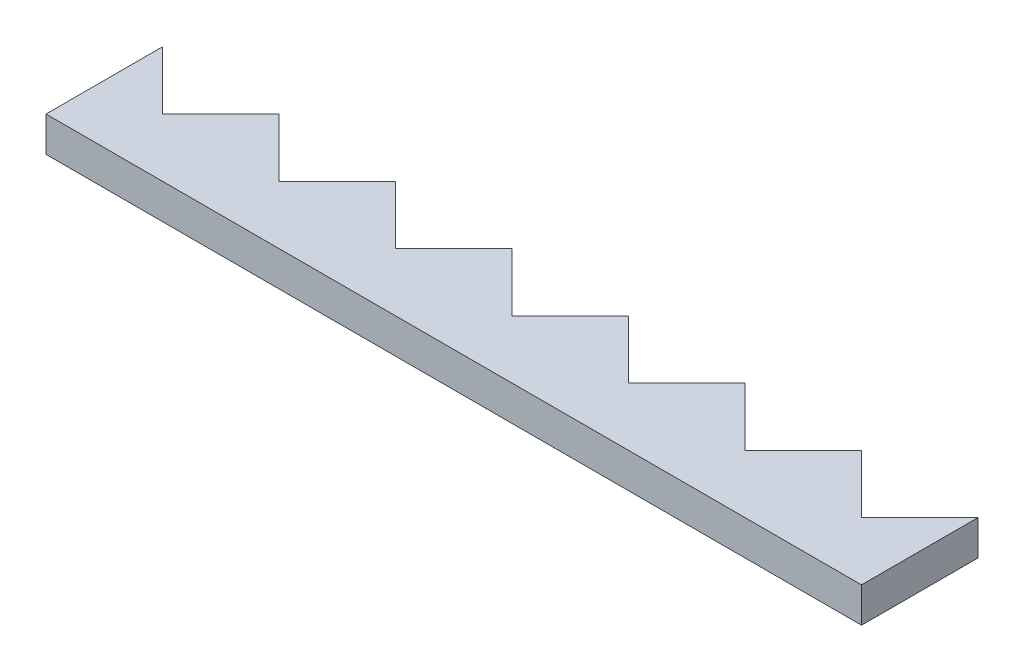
ISO-10303-21;
HEADER;
FILE_DESCRIPTION(('STEP AP214'),'2;1');
FILE_NAME('part.step','',(''),(''),'','','');
FILE_SCHEMA(('AUTOMOTIVE_DESIGN { 1 0 10303 214 1 1 1 1 }'));
ENDSEC;
DATA;
#1=APPLICATION_CONTEXT('core data for automotive mechanical design processes');
#2=APPLICATION_PROTOCOL_DEFINITION('international standard','automotive_design',2000,#1);
#3=PRODUCT_CONTEXT('',#1,'mechanical');
#4=PRODUCT('Part','Part','',(#3));
#5=PRODUCT_RELATED_PRODUCT_CATEGORY('part','',(#4));
#6=PRODUCT_DEFINITION_FORMATION('','',#4);
#7=PRODUCT_DEFINITION_CONTEXT('part definition',#1,'design');
#8=PRODUCT_DEFINITION('design','',#6,#7);
#9=PRODUCT_DEFINITION_SHAPE('','',#8);
#10=(LENGTH_UNIT() NAMED_UNIT(*) SI_UNIT(.MILLI.,.METRE.));
#11=(NAMED_UNIT(*) PLANE_ANGLE_UNIT() SI_UNIT($,.RADIAN.));
#12=(NAMED_UNIT(*) SI_UNIT($,.STERADIAN.) SOLID_ANGLE_UNIT());
#13=UNCERTAINTY_MEASURE_WITH_UNIT(LENGTH_MEASURE(1.E-05),#10,'distance_accuracy_value','');
#14=(GEOMETRIC_REPRESENTATION_CONTEXT(3) GLOBAL_UNCERTAINTY_ASSIGNED_CONTEXT((#13)) GLOBAL_UNIT_ASSIGNED_CONTEXT((#10,
#11,#12)) REPRESENTATION_CONTEXT('',''));
#15=CARTESIAN_POINT('',(0.,0.,0.));
#16=DIRECTION('',(0.,0.,1.));
#17=DIRECTION('',(1.,0.,0.));
#18=AXIS2_PLACEMENT_3D('',#15,#16,#17);
#19=CARTESIAN_POINT('',(0.,6.,0.));
#20=DIRECTION('',(0.,0.,-1.));
#21=DIRECTION('',(-1.,0.,0.));
#22=AXIS2_PLACEMENT_3D('',#19,#20,#21);
#23=PLANE('',#22);
#24=DIRECTION('',(1.,0.,0.));
#25=VECTOR('',#24,1.);
#26=CARTESIAN_POINT('',(0.,3.,0.));
#27=LINE('',#26,#25);
#28=CARTESIAN_POINT('',(0.,3.,0.));
#29=VERTEX_POINT('',#28);
#30=CARTESIAN_POINT('',(70.,3.,0.));
#31=VERTEX_POINT('',#30);
#32=EDGE_CURVE('E183',#29,#31,#27,.T.);
#33=ORIENTED_EDGE('',*,*,#32,.T.);
#34=DIRECTION('',(0.,-1.,0.));
#35=VECTOR('',#34,1.);
#36=CARTESIAN_POINT('',(70.,6.,0.));
#37=LINE('',#36,#35);
#38=CARTESIAN_POINT('',(70.,6.,0.));
#39=VERTEX_POINT('',#38);
#40=EDGE_CURVE('E11',#39,#31,#37,.T.);
#41=ORIENTED_EDGE('',*,*,#40,.F.);
#42=DIRECTION('',(1.,0.,0.));
#43=VECTOR('',#42,1.);
#44=CARTESIAN_POINT('',(0.,6.,0.));
#45=LINE('',#44,#43);
#46=CARTESIAN_POINT('',(0.,6.,0.));
#47=VERTEX_POINT('',#46);
#48=EDGE_CURVE('E215',#47,#39,#45,.T.);
#49=ORIENTED_EDGE('',*,*,#48,.F.);
#50=DIRECTION('',(0.,-1.,0.));
#51=VECTOR('',#50,1.);
#52=CARTESIAN_POINT('',(0.,6.,0.));
#53=LINE('',#52,#51);
#54=EDGE_CURVE('E179',#47,#29,#53,.T.);
#55=ORIENTED_EDGE('',*,*,#54,.T.);
#56=EDGE_LOOP('',(#33,#41,#49,#55));
#57=FACE_BOUND('',#56,.T.);
#58=ADVANCED_FACE('F33',(#57),#23,.F.);
#59=CARTESIAN_POINT('',(70.,6.,0.));
#60=DIRECTION('',(-1.,0.,0.));
#61=DIRECTION('',(0.,0.,1.));
#62=AXIS2_PLACEMENT_3D('',#59,#60,#61);
#63=PLANE('',#62);
#64=DIRECTION('',(0.,0.,-1.));
#65=VECTOR('',#64,1.);
#66=CARTESIAN_POINT('',(70.,3.,0.));
#67=LINE('',#66,#65);
#68=CARTESIAN_POINT('',(70.,3.,-10.));
#69=VERTEX_POINT('',#68);
#70=EDGE_CURVE('E186',#31,#69,#67,.T.);
#71=ORIENTED_EDGE('',*,*,#70,.T.);
#72=DIRECTION('',(0.,-1.,0.));
#73=VECTOR('',#72,1.);
#74=CARTESIAN_POINT('',(70.,6.,-10.));
#75=LINE('',#74,#73);
#76=CARTESIAN_POINT('',(70.,6.,-10.));
#77=VERTEX_POINT('',#76);
#78=EDGE_CURVE('E41',#77,#69,#75,.T.);
#79=ORIENTED_EDGE('',*,*,#78,.F.);
#80=DIRECTION('',(0.,0.,-1.));
#81=VECTOR('',#80,1.);
#82=CARTESIAN_POINT('',(70.,6.,0.));
#83=LINE('',#82,#81);
#84=EDGE_CURVE('E119',#39,#77,#83,.T.);
#85=ORIENTED_EDGE('',*,*,#84,.F.);
#86=ORIENTED_EDGE('',*,*,#40,.T.);
#87=EDGE_LOOP('',(#71,#79,#85,#86));
#88=FACE_BOUND('',#87,.T.);
#89=ADVANCED_FACE('F318',(#88),#63,.F.);
#90=CARTESIAN_POINT('',(65.,6.,-5.));
#91=DIRECTION('',(0.707106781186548,0.,0.707106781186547));
#92=DIRECTION('',(0.707106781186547,0.,-0.707106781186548));
#93=AXIS2_PLACEMENT_3D('',#90,#91,#92);
#94=PLANE('',#93);
#95=DIRECTION('',(-0.707106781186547,0.,0.707106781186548));
#96=VECTOR('',#95,1.);
#97=CARTESIAN_POINT('',(65.,3.,-5.));
#98=LINE('',#97,#96);
#99=CARTESIAN_POINT('',(65.,3.,-5.));
#100=VERTEX_POINT('',#99);
#101=EDGE_CURVE('E188',#69,#100,#98,.T.);
#102=ORIENTED_EDGE('',*,*,#101,.T.);
#103=DIRECTION('',(0.,-1.,0.));
#104=VECTOR('',#103,1.);
#105=CARTESIAN_POINT('',(65.,6.,-5.));
#106=LINE('',#105,#104);
#107=CARTESIAN_POINT('',(65.,6.,-5.));
#108=VERTEX_POINT('',#107);
#109=EDGE_CURVE('E249',#108,#100,#106,.T.);
#110=ORIENTED_EDGE('',*,*,#109,.F.);
#111=DIRECTION('',(-0.707106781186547,0.,0.707106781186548));
#112=VECTOR('',#111,1.);
#113=CARTESIAN_POINT('',(65.,6.,-5.));
#114=LINE('',#113,#112);
#115=EDGE_CURVE('E257',#77,#108,#114,.T.);
#116=ORIENTED_EDGE('',*,*,#115,.F.);
#117=ORIENTED_EDGE('',*,*,#78,.T.);
#118=EDGE_LOOP('',(#102,#110,#116,#117));
#119=FACE_BOUND('',#118,.T.);
#120=ADVANCED_FACE('F255',(#119),#94,.F.);
#121=CARTESIAN_POINT('',(60.,6.,-10.));
#122=DIRECTION('',(-0.707106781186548,0.,0.707106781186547));
#123=DIRECTION('',(0.707106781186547,0.,0.707106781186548));
#124=AXIS2_PLACEMENT_3D('',#121,#122,#123);
#125=PLANE('',#124);
#126=DIRECTION('',(-0.707106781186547,0.,-0.707106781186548));
#127=VECTOR('',#126,1.);
#128=CARTESIAN_POINT('',(60.,3.,-10.));
#129=LINE('',#128,#127);
#130=CARTESIAN_POINT('',(60.,3.,-10.));
#131=VERTEX_POINT('',#130);
#132=EDGE_CURVE('E190',#100,#131,#129,.T.);
#133=ORIENTED_EDGE('',*,*,#132,.T.);
#134=DIRECTION('',(0.,-1.,0.));
#135=VECTOR('',#134,1.);
#136=CARTESIAN_POINT('',(60.,6.,-10.));
#137=LINE('',#136,#135);
#138=CARTESIAN_POINT('',(60.,6.,-10.));
#139=VERTEX_POINT('',#138);
#140=EDGE_CURVE('E246',#139,#131,#137,.T.);
#141=ORIENTED_EDGE('',*,*,#140,.F.);
#142=DIRECTION('',(-0.707106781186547,0.,-0.707106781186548));
#143=VECTOR('',#142,1.);
#144=CARTESIAN_POINT('',(60.,6.,-10.));
#145=LINE('',#144,#143);
#146=EDGE_CURVE('E275',#108,#139,#145,.T.);
#147=ORIENTED_EDGE('',*,*,#146,.F.);
#148=ORIENTED_EDGE('',*,*,#109,.T.);
#149=EDGE_LOOP('',(#133,#141,#147,#148));
#150=FACE_BOUND('',#149,.T.);
#151=ADVANCED_FACE('F266',(#150),#125,.F.);
#152=CARTESIAN_POINT('',(55.,6.,-5.));
#153=DIRECTION('',(0.707106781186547,0.,0.707106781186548));
#154=DIRECTION('',(0.707106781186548,0.,-0.707106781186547));
#155=AXIS2_PLACEMENT_3D('',#152,#153,#154);
#156=PLANE('',#155);
#157=DIRECTION('',(-0.707106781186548,0.,0.707106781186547));
#158=VECTOR('',#157,1.);
#159=CARTESIAN_POINT('',(55.,3.,-5.));
#160=LINE('',#159,#158);
#161=CARTESIAN_POINT('',(55.,3.,-5.));
#162=VERTEX_POINT('',#161);
#163=EDGE_CURVE('E192',#131,#162,#160,.T.);
#164=ORIENTED_EDGE('',*,*,#163,.T.);
#165=DIRECTION('',(0.,-1.,0.));
#166=VECTOR('',#165,1.);
#167=CARTESIAN_POINT('',(55.,6.,-5.));
#168=LINE('',#167,#166);
#169=CARTESIAN_POINT('',(55.,6.,-5.));
#170=VERTEX_POINT('',#169);
#171=EDGE_CURVE('E243',#170,#162,#168,.T.);
#172=ORIENTED_EDGE('',*,*,#171,.F.);
#173=DIRECTION('',(-0.707106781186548,0.,0.707106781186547));
#174=VECTOR('',#173,1.);
#175=CARTESIAN_POINT('',(55.,6.,-5.));
#176=LINE('',#175,#174);
#177=EDGE_CURVE('E272',#139,#170,#176,.T.);
#178=ORIENTED_EDGE('',*,*,#177,.F.);
#179=ORIENTED_EDGE('',*,*,#140,.T.);
#180=EDGE_LOOP('',(#164,#172,#178,#179));
#181=FACE_BOUND('',#180,.T.);
#182=ADVANCED_FACE('F270',(#181),#156,.F.);
#183=CARTESIAN_POINT('',(50.,6.,-10.));
#184=DIRECTION('',(-0.707106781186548,0.,0.707106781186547));
#185=DIRECTION('',(0.707106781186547,0.,0.707106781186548));
#186=AXIS2_PLACEMENT_3D('',#183,#184,#185);
#187=PLANE('',#186);
#188=DIRECTION('',(-0.707106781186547,0.,-0.707106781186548));
#189=VECTOR('',#188,1.);
#190=CARTESIAN_POINT('',(50.,3.,-10.));
#191=LINE('',#190,#189);
#192=CARTESIAN_POINT('',(50.,3.,-10.));
#193=VERTEX_POINT('',#192);
#194=EDGE_CURVE('E194',#162,#193,#191,.T.);
#195=ORIENTED_EDGE('',*,*,#194,.T.);
#196=DIRECTION('',(0.,-1.,0.));
#197=VECTOR('',#196,1.);
#198=CARTESIAN_POINT('',(50.,6.,-10.));
#199=LINE('',#198,#197);
#200=CARTESIAN_POINT('',(50.,6.,-10.));
#201=VERTEX_POINT('',#200);
#202=EDGE_CURVE('E240',#201,#193,#199,.T.);
#203=ORIENTED_EDGE('',*,*,#202,.F.);
#204=DIRECTION('',(-0.707106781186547,0.,-0.707106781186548));
#205=VECTOR('',#204,1.);
#206=CARTESIAN_POINT('',(50.,6.,-10.));
#207=LINE('',#206,#205);
#208=EDGE_CURVE('E274',#170,#201,#207,.T.);
#209=ORIENTED_EDGE('',*,*,#208,.F.);
#210=ORIENTED_EDGE('',*,*,#171,.T.);
#211=EDGE_LOOP('',(#195,#203,#209,#210));
#212=FACE_BOUND('',#211,.T.);
#213=ADVANCED_FACE('F331',(#212),#187,.F.);
#214=CARTESIAN_POINT('',(45.,6.,-5.));
#215=DIRECTION('',(0.707106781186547,0.,0.707106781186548));
#216=DIRECTION('',(0.707106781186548,0.,-0.707106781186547));
#217=AXIS2_PLACEMENT_3D('',#214,#215,#216);
#218=PLANE('',#217);
#219=DIRECTION('',(-0.707106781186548,0.,0.707106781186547));
#220=VECTOR('',#219,1.);
#221=CARTESIAN_POINT('',(45.,3.,-5.));
#222=LINE('',#221,#220);
#223=CARTESIAN_POINT('',(45.,3.,-5.));
#224=VERTEX_POINT('',#223);
#225=EDGE_CURVE('E196',#193,#224,#222,.T.);
#226=ORIENTED_EDGE('',*,*,#225,.T.);
#227=DIRECTION('',(0.,-1.,0.));
#228=VECTOR('',#227,1.);
#229=CARTESIAN_POINT('',(45.,6.,-5.));
#230=LINE('',#229,#228);
#231=CARTESIAN_POINT('',(45.,6.,-5.));
#232=VERTEX_POINT('',#231);
#233=EDGE_CURVE('E237',#232,#224,#230,.T.);
#234=ORIENTED_EDGE('',*,*,#233,.F.);
#235=DIRECTION('',(-0.707106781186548,0.,0.707106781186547));
#236=VECTOR('',#235,1.);
#237=CARTESIAN_POINT('',(45.,6.,-5.));
#238=LINE('',#237,#236);
#239=EDGE_CURVE('E277',#201,#232,#238,.T.);
#240=ORIENTED_EDGE('',*,*,#239,.F.);
#241=ORIENTED_EDGE('',*,*,#202,.T.);
#242=EDGE_LOOP('',(#226,#234,#240,#241));
#243=FACE_BOUND('',#242,.T.);
#244=ADVANCED_FACE('F334',(#243),#218,.F.);
#245=CARTESIAN_POINT('',(40.,6.,-10.));
#246=DIRECTION('',(-0.707106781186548,0.,0.707106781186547));
#247=DIRECTION('',(0.707106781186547,0.,0.707106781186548));
#248=AXIS2_PLACEMENT_3D('',#245,#246,#247);
#249=PLANE('',#248);
#250=DIRECTION('',(-0.707106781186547,0.,-0.707106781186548));
#251=VECTOR('',#250,1.);
#252=CARTESIAN_POINT('',(40.,3.,-10.));
#253=LINE('',#252,#251);
#254=CARTESIAN_POINT('',(40.,3.,-10.));
#255=VERTEX_POINT('',#254);
#256=EDGE_CURVE('E198',#224,#255,#253,.T.);
#257=ORIENTED_EDGE('',*,*,#256,.T.);
#258=DIRECTION('',(0.,-1.,0.));
#259=VECTOR('',#258,1.);
#260=CARTESIAN_POINT('',(40.,6.,-10.));
#261=LINE('',#260,#259);
#262=CARTESIAN_POINT('',(40.,6.,-10.));
#263=VERTEX_POINT('',#262);
#264=EDGE_CURVE('E234',#263,#255,#261,.T.);
#265=ORIENTED_EDGE('',*,*,#264,.F.);
#266=DIRECTION('',(-0.707106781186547,0.,-0.707106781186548));
#267=VECTOR('',#266,1.);
#268=CARTESIAN_POINT('',(40.,6.,-10.));
#269=LINE('',#268,#267);
#270=EDGE_CURVE('E283',#232,#263,#269,.T.);
#271=ORIENTED_EDGE('',*,*,#270,.F.);
#272=ORIENTED_EDGE('',*,*,#233,.T.);
#273=EDGE_LOOP('',(#257,#265,#271,#272));
#274=FACE_BOUND('',#273,.T.);
#275=ADVANCED_FACE('F338',(#274),#249,.F.);
#276=CARTESIAN_POINT('',(35.,6.,-5.));
#277=DIRECTION('',(0.707106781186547,0.,0.707106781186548));
#278=DIRECTION('',(0.707106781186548,0.,-0.707106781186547));
#279=AXIS2_PLACEMENT_3D('',#276,#277,#278);
#280=PLANE('',#279);
#281=DIRECTION('',(-0.707106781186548,0.,0.707106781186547));
#282=VECTOR('',#281,1.);
#283=CARTESIAN_POINT('',(35.,3.,-5.));
#284=LINE('',#283,#282);
#285=CARTESIAN_POINT('',(35.,3.,-5.));
#286=VERTEX_POINT('',#285);
#287=EDGE_CURVE('E200',#255,#286,#284,.T.);
#288=ORIENTED_EDGE('',*,*,#287,.T.);
#289=DIRECTION('',(0.,-1.,0.));
#290=VECTOR('',#289,1.);
#291=CARTESIAN_POINT('',(35.,6.,-5.));
#292=LINE('',#291,#290);
#293=CARTESIAN_POINT('',(35.,6.,-5.));
#294=VERTEX_POINT('',#293);
#295=EDGE_CURVE('E231',#294,#286,#292,.T.);
#296=ORIENTED_EDGE('',*,*,#295,.F.);
#297=DIRECTION('',(-0.707106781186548,0.,0.707106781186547));
#298=VECTOR('',#297,1.);
#299=CARTESIAN_POINT('',(35.,6.,-5.));
#300=LINE('',#299,#298);
#301=EDGE_CURVE('E285',#263,#294,#300,.T.);
#302=ORIENTED_EDGE('',*,*,#301,.F.);
#303=ORIENTED_EDGE('',*,*,#264,.T.);
#304=EDGE_LOOP('',(#288,#296,#302,#303));
#305=FACE_BOUND('',#304,.T.);
#306=ADVANCED_FACE('F342',(#305),#280,.F.);
#307=CARTESIAN_POINT('',(30.,6.,-10.));
#308=DIRECTION('',(-0.707106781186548,0.,0.707106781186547));
#309=DIRECTION('',(0.707106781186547,0.,0.707106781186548));
#310=AXIS2_PLACEMENT_3D('',#307,#308,#309);
#311=PLANE('',#310);
#312=DIRECTION('',(-0.707106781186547,0.,-0.707106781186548));
#313=VECTOR('',#312,1.);
#314=CARTESIAN_POINT('',(30.,3.,-10.));
#315=LINE('',#314,#313);
#316=CARTESIAN_POINT('',(30.,3.,-10.));
#317=VERTEX_POINT('',#316);
#318=EDGE_CURVE('E202',#286,#317,#315,.T.);
#319=ORIENTED_EDGE('',*,*,#318,.T.);
#320=DIRECTION('',(0.,-1.,0.));
#321=VECTOR('',#320,1.);
#322=CARTESIAN_POINT('',(30.,6.,-10.));
#323=LINE('',#322,#321);
#324=CARTESIAN_POINT('',(30.,6.,-10.));
#325=VERTEX_POINT('',#324);
#326=EDGE_CURVE('E228',#325,#317,#323,.T.);
#327=ORIENTED_EDGE('',*,*,#326,.F.);
#328=DIRECTION('',(-0.707106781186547,0.,-0.707106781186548));
#329=VECTOR('',#328,1.);
#330=CARTESIAN_POINT('',(30.,6.,-10.));
#331=LINE('',#330,#329);
#332=EDGE_CURVE('E287',#294,#325,#331,.T.);
#333=ORIENTED_EDGE('',*,*,#332,.F.);
#334=ORIENTED_EDGE('',*,*,#295,.T.);
#335=EDGE_LOOP('',(#319,#327,#333,#334));
#336=FACE_BOUND('',#335,.T.);
#337=ADVANCED_FACE('F346',(#336),#311,.F.);
#338=CARTESIAN_POINT('',(25.,6.,-5.));
#339=DIRECTION('',(0.707106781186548,0.,0.707106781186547));
#340=DIRECTION('',(0.707106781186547,0.,-0.707106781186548));
#341=AXIS2_PLACEMENT_3D('',#338,#339,#340);
#342=PLANE('',#341);
#343=DIRECTION('',(-0.707106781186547,0.,0.707106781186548));
#344=VECTOR('',#343,1.);
#345=CARTESIAN_POINT('',(25.,3.,-5.));
#346=LINE('',#345,#344);
#347=CARTESIAN_POINT('',(25.,3.,-5.));
#348=VERTEX_POINT('',#347);
#349=EDGE_CURVE('E204',#317,#348,#346,.T.);
#350=ORIENTED_EDGE('',*,*,#349,.T.);
#351=DIRECTION('',(0.,-1.,0.));
#352=VECTOR('',#351,1.);
#353=CARTESIAN_POINT('',(25.,6.,-5.));
#354=LINE('',#353,#352);
#355=CARTESIAN_POINT('',(25.,6.,-5.));
#356=VERTEX_POINT('',#355);
#357=EDGE_CURVE('E225',#356,#348,#354,.T.);
#358=ORIENTED_EDGE('',*,*,#357,.F.);
#359=DIRECTION('',(-0.707106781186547,0.,0.707106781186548));
#360=VECTOR('',#359,1.);
#361=CARTESIAN_POINT('',(25.,6.,-5.));
#362=LINE('',#361,#360);
#363=EDGE_CURVE('E289',#325,#356,#362,.T.);
#364=ORIENTED_EDGE('',*,*,#363,.F.);
#365=ORIENTED_EDGE('',*,*,#326,.T.);
#366=EDGE_LOOP('',(#350,#358,#364,#365));
#367=FACE_BOUND('',#366,.T.);
#368=ADVANCED_FACE('F350',(#367),#342,.F.);
#369=CARTESIAN_POINT('',(20.,6.,-10.));
#370=DIRECTION('',(-0.707106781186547,0.,0.707106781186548));
#371=DIRECTION('',(0.707106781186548,0.,0.707106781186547));
#372=AXIS2_PLACEMENT_3D('',#369,#370,#371);
#373=PLANE('',#372);
#374=DIRECTION('',(-0.707106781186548,0.,-0.707106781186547));
#375=VECTOR('',#374,1.);
#376=CARTESIAN_POINT('',(20.,3.,-10.));
#377=LINE('',#376,#375);
#378=CARTESIAN_POINT('',(20.,3.,-10.));
#379=VERTEX_POINT('',#378);
#380=EDGE_CURVE('E206',#348,#379,#377,.T.);
#381=ORIENTED_EDGE('',*,*,#380,.T.);
#382=DIRECTION('',(0.,-1.,0.));
#383=VECTOR('',#382,1.);
#384=CARTESIAN_POINT('',(20.,6.,-10.));
#385=LINE('',#384,#383);
#386=CARTESIAN_POINT('',(20.,6.,-10.));
#387=VERTEX_POINT('',#386);
#388=EDGE_CURVE('E222',#387,#379,#385,.T.);
#389=ORIENTED_EDGE('',*,*,#388,.F.);
#390=DIRECTION('',(-0.707106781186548,0.,-0.707106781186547));
#391=VECTOR('',#390,1.);
#392=CARTESIAN_POINT('',(20.,6.,-10.));
#393=LINE('',#392,#391);
#394=EDGE_CURVE('E291',#356,#387,#393,.T.);
#395=ORIENTED_EDGE('',*,*,#394,.F.);
#396=ORIENTED_EDGE('',*,*,#357,.T.);
#397=EDGE_LOOP('',(#381,#389,#395,#396));
#398=FACE_BOUND('',#397,.T.);
#399=ADVANCED_FACE('F354',(#398),#373,.F.);
#400=CARTESIAN_POINT('',(15.,6.,-5.));
#401=DIRECTION('',(0.707106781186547,0.,0.707106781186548));
#402=DIRECTION('',(0.707106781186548,0.,-0.707106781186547));
#403=AXIS2_PLACEMENT_3D('',#400,#401,#402);
#404=PLANE('',#403);
#405=DIRECTION('',(-0.707106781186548,0.,0.707106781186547));
#406=VECTOR('',#405,1.);
#407=CARTESIAN_POINT('',(15.,3.,-5.));
#408=LINE('',#407,#406);
#409=CARTESIAN_POINT('',(15.,3.,-5.));
#410=VERTEX_POINT('',#409);
#411=EDGE_CURVE('E208',#379,#410,#408,.T.);
#412=ORIENTED_EDGE('',*,*,#411,.T.);
#413=DIRECTION('',(0.,-1.,0.));
#414=VECTOR('',#413,1.);
#415=CARTESIAN_POINT('',(15.,6.,-5.));
#416=LINE('',#415,#414);
#417=CARTESIAN_POINT('',(15.,6.,-5.));
#418=VERTEX_POINT('',#417);
#419=EDGE_CURVE('E219',#418,#410,#416,.T.);
#420=ORIENTED_EDGE('',*,*,#419,.F.);
#421=DIRECTION('',(-0.707106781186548,0.,0.707106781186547));
#422=VECTOR('',#421,1.);
#423=CARTESIAN_POINT('',(15.,6.,-5.));
#424=LINE('',#423,#422);
#425=EDGE_CURVE('E293',#387,#418,#424,.T.);
#426=ORIENTED_EDGE('',*,*,#425,.F.);
#427=ORIENTED_EDGE('',*,*,#388,.T.);
#428=EDGE_LOOP('',(#412,#420,#426,#427));
#429=FACE_BOUND('',#428,.T.);
#430=ADVANCED_FACE('F299',(#429),#404,.F.);
#431=CARTESIAN_POINT('',(10.,6.,-10.));
#432=DIRECTION('',(-0.707106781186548,0.,0.707106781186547));
#433=DIRECTION('',(0.707106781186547,0.,0.707106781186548));
#434=AXIS2_PLACEMENT_3D('',#431,#432,#433);
#435=PLANE('',#434);
#436=DIRECTION('',(-0.707106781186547,0.,-0.707106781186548));
#437=VECTOR('',#436,1.);
#438=CARTESIAN_POINT('',(10.,3.,-10.));
#439=LINE('',#438,#437);
#440=CARTESIAN_POINT('',(10.,3.,-10.));
#441=VERTEX_POINT('',#440);
#442=EDGE_CURVE('E210',#410,#441,#439,.T.);
#443=ORIENTED_EDGE('',*,*,#442,.T.);
#444=DIRECTION('',(0.,-1.,0.));
#445=VECTOR('',#444,1.);
#446=CARTESIAN_POINT('',(10.,6.,-10.));
#447=LINE('',#446,#445);
#448=CARTESIAN_POINT('',(10.,6.,-10.));
#449=VERTEX_POINT('',#448);
#450=EDGE_CURVE('E174',#449,#441,#447,.T.);
#451=ORIENTED_EDGE('',*,*,#450,.F.);
#452=DIRECTION('',(-0.707106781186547,0.,-0.707106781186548));
#453=VECTOR('',#452,1.);
#454=CARTESIAN_POINT('',(10.,6.,-10.));
#455=LINE('',#454,#453);
#456=EDGE_CURVE('E165',#418,#449,#455,.T.);
#457=ORIENTED_EDGE('',*,*,#456,.F.);
#458=ORIENTED_EDGE('',*,*,#419,.T.);
#459=EDGE_LOOP('',(#443,#451,#457,#458));
#460=FACE_BOUND('',#459,.T.);
#461=ADVANCED_FACE('F303',(#460),#435,.F.);
#462=CARTESIAN_POINT('',(5.,6.,-5.));
#463=DIRECTION('',(0.707106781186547,0.,0.707106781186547));
#464=DIRECTION('',(0.707106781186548,0.,-0.707106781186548));
#465=AXIS2_PLACEMENT_3D('',#462,#463,#464);
#466=PLANE('',#465);
#467=DIRECTION('',(-0.707106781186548,0.,0.707106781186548));
#468=VECTOR('',#467,1.);
#469=CARTESIAN_POINT('',(5.,3.,-5.));
#470=LINE('',#469,#468);
#471=CARTESIAN_POINT('',(5.,3.,-5.));
#472=VERTEX_POINT('',#471);
#473=EDGE_CURVE('E173',#441,#472,#470,.T.);
#474=ORIENTED_EDGE('',*,*,#473,.T.);
#475=DIRECTION('',(0.,-1.,0.));
#476=VECTOR('',#475,1.);
#477=CARTESIAN_POINT('',(5.,6.,-5.));
#478=LINE('',#477,#476);
#479=CARTESIAN_POINT('',(5.,6.,-5.));
#480=VERTEX_POINT('',#479);
#481=EDGE_CURVE('E170',#480,#472,#478,.T.);
#482=ORIENTED_EDGE('',*,*,#481,.F.);
#483=DIRECTION('',(-0.707106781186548,0.,0.707106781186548));
#484=VECTOR('',#483,1.);
#485=CARTESIAN_POINT('',(5.,6.,-5.));
#486=LINE('',#485,#484);
#487=EDGE_CURVE('E159',#449,#480,#486,.T.);
#488=ORIENTED_EDGE('',*,*,#487,.F.);
#489=ORIENTED_EDGE('',*,*,#450,.T.);
#490=EDGE_LOOP('',(#474,#482,#488,#489));
#491=FACE_BOUND('',#490,.T.);
#492=ADVANCED_FACE('F171',(#491),#466,.F.);
#493=CARTESIAN_POINT('',(0.,6.,-10.));
#494=DIRECTION('',(-0.707106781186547,0.,0.707106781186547));
#495=DIRECTION('',(0.707106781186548,0.,0.707106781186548));
#496=AXIS2_PLACEMENT_3D('',#493,#494,#495);
#497=PLANE('',#496);
#498=DIRECTION('',(-0.707106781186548,0.,-0.707106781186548));
#499=VECTOR('',#498,1.);
#500=CARTESIAN_POINT('',(0.,3.,-10.));
#501=LINE('',#500,#499);
#502=CARTESIAN_POINT('',(0.,3.,-10.));
#503=VERTEX_POINT('',#502);
#504=EDGE_CURVE('E105',#472,#503,#501,.T.);
#505=ORIENTED_EDGE('',*,*,#504,.T.);
#506=DIRECTION('',(0.,-1.,0.));
#507=VECTOR('',#506,1.);
#508=CARTESIAN_POINT('',(0.,6.,-10.));
#509=LINE('',#508,#507);
#510=CARTESIAN_POINT('',(0.,6.,-10.));
#511=VERTEX_POINT('',#510);
#512=EDGE_CURVE('E175',#511,#503,#509,.T.);
#513=ORIENTED_EDGE('',*,*,#512,.F.);
#514=DIRECTION('',(-0.707106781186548,0.,-0.707106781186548));
#515=VECTOR('',#514,1.);
#516=CARTESIAN_POINT('',(0.,6.,-10.));
#517=LINE('',#516,#515);
#518=EDGE_CURVE('E163',#480,#511,#517,.T.);
#519=ORIENTED_EDGE('',*,*,#518,.F.);
#520=ORIENTED_EDGE('',*,*,#481,.T.);
#521=EDGE_LOOP('',(#505,#513,#519,#520));
#522=FACE_BOUND('',#521,.T.);
#523=ADVANCED_FACE('F177',(#522),#497,.F.);
#524=CARTESIAN_POINT('',(0.,6.,0.));
#525=DIRECTION('',(1.,0.,0.));
#526=DIRECTION('',(0.,0.,-1.));
#527=AXIS2_PLACEMENT_3D('',#524,#525,#526);
#528=PLANE('',#527);
#529=DIRECTION('',(0.,0.,1.));
#530=VECTOR('',#529,1.);
#531=CARTESIAN_POINT('',(0.,3.,0.));
#532=LINE('',#531,#530);
#533=EDGE_CURVE('E111',#503,#29,#532,.T.);
#534=ORIENTED_EDGE('',*,*,#533,.T.);
#535=ORIENTED_EDGE('',*,*,#54,.F.);
#536=DIRECTION('',(0.,0.,1.));
#537=VECTOR('',#536,1.);
#538=CARTESIAN_POINT('',(0.,6.,0.));
#539=LINE('',#538,#537);
#540=EDGE_CURVE('E49',#511,#47,#539,.T.);
#541=ORIENTED_EDGE('',*,*,#540,.F.);
#542=ORIENTED_EDGE('',*,*,#512,.T.);
#543=EDGE_LOOP('',(#534,#535,#541,#542));
#544=FACE_BOUND('',#543,.T.);
#545=ADVANCED_FACE('F307',(#544),#528,.F.);
#546=CARTESIAN_POINT('',(0.,6.,0.));
#547=DIRECTION('',(0.,1.,0.));
#548=DIRECTION('',(0.,0.,1.));
#549=AXIS2_PLACEMENT_3D('',#546,#547,#548);
#550=PLANE('',#549);
#551=ORIENTED_EDGE('',*,*,#48,.T.);
#552=ORIENTED_EDGE('',*,*,#84,.T.);
#553=ORIENTED_EDGE('',*,*,#115,.T.);
#554=ORIENTED_EDGE('',*,*,#146,.T.);
#555=ORIENTED_EDGE('',*,*,#177,.T.);
#556=ORIENTED_EDGE('',*,*,#208,.T.);
#557=ORIENTED_EDGE('',*,*,#239,.T.);
#558=ORIENTED_EDGE('',*,*,#270,.T.);
#559=ORIENTED_EDGE('',*,*,#301,.T.);
#560=ORIENTED_EDGE('',*,*,#332,.T.);
#561=ORIENTED_EDGE('',*,*,#363,.T.);
#562=ORIENTED_EDGE('',*,*,#394,.T.);
#563=ORIENTED_EDGE('',*,*,#425,.T.);
#564=ORIENTED_EDGE('',*,*,#456,.T.);
#565=ORIENTED_EDGE('',*,*,#487,.T.);
#566=ORIENTED_EDGE('',*,*,#518,.T.);
#567=ORIENTED_EDGE('',*,*,#540,.T.);
#568=EDGE_LOOP('',(#551,#552,#553,#554,#555,#556,#557,#558,#559,#560,#561,#562,#563,#564,#565,
#566,#567));
#569=FACE_BOUND('',#568,.T.);
#570=ADVANCED_FACE('F161',(#569),#550,.T.);
#571=CARTESIAN_POINT('',(0.,3.,0.));
#572=DIRECTION('',(0.,1.,0.));
#573=DIRECTION('',(0.,0.,1.));
#574=AXIS2_PLACEMENT_3D('',#571,#572,#573);
#575=PLANE('',#574);
#576=ORIENTED_EDGE('',*,*,#32,.F.);
#577=ORIENTED_EDGE('',*,*,#533,.F.);
#578=ORIENTED_EDGE('',*,*,#504,.F.);
#579=ORIENTED_EDGE('',*,*,#473,.F.);
#580=ORIENTED_EDGE('',*,*,#442,.F.);
#581=ORIENTED_EDGE('',*,*,#411,.F.);
#582=ORIENTED_EDGE('',*,*,#380,.F.);
#583=ORIENTED_EDGE('',*,*,#349,.F.);
#584=ORIENTED_EDGE('',*,*,#318,.F.);
#585=ORIENTED_EDGE('',*,*,#287,.F.);
#586=ORIENTED_EDGE('',*,*,#256,.F.);
#587=ORIENTED_EDGE('',*,*,#225,.F.);
#588=ORIENTED_EDGE('',*,*,#194,.F.);
#589=ORIENTED_EDGE('',*,*,#163,.F.);
#590=ORIENTED_EDGE('',*,*,#132,.F.);
#591=ORIENTED_EDGE('',*,*,#101,.F.);
#592=ORIENTED_EDGE('',*,*,#70,.F.);
#593=EDGE_LOOP('',(#576,#577,#578,#579,#580,#581,#582,#583,#584,#585,#586,#587,#588,#589,#590,
#591,#592));
#594=FACE_BOUND('',#593,.T.);
#595=ADVANCED_FACE('F261',(#594),#575,.F.);
#596=CLOSED_SHELL('',(#58,#89,#120,#151,#182,#213,#244,#275,#306,#337,#368,#399,#430,#461,#492,
#523,#545,#570,#595));
#597=MANIFOLD_SOLID_BREP('B2',#596);
#598=ADVANCED_BREP_SHAPE_REPRESENTATION('',(#18,#597),#14);
#599=SHAPE_DEFINITION_REPRESENTATION(#9,#598);
ENDSEC;
END-ISO-10303-21;
